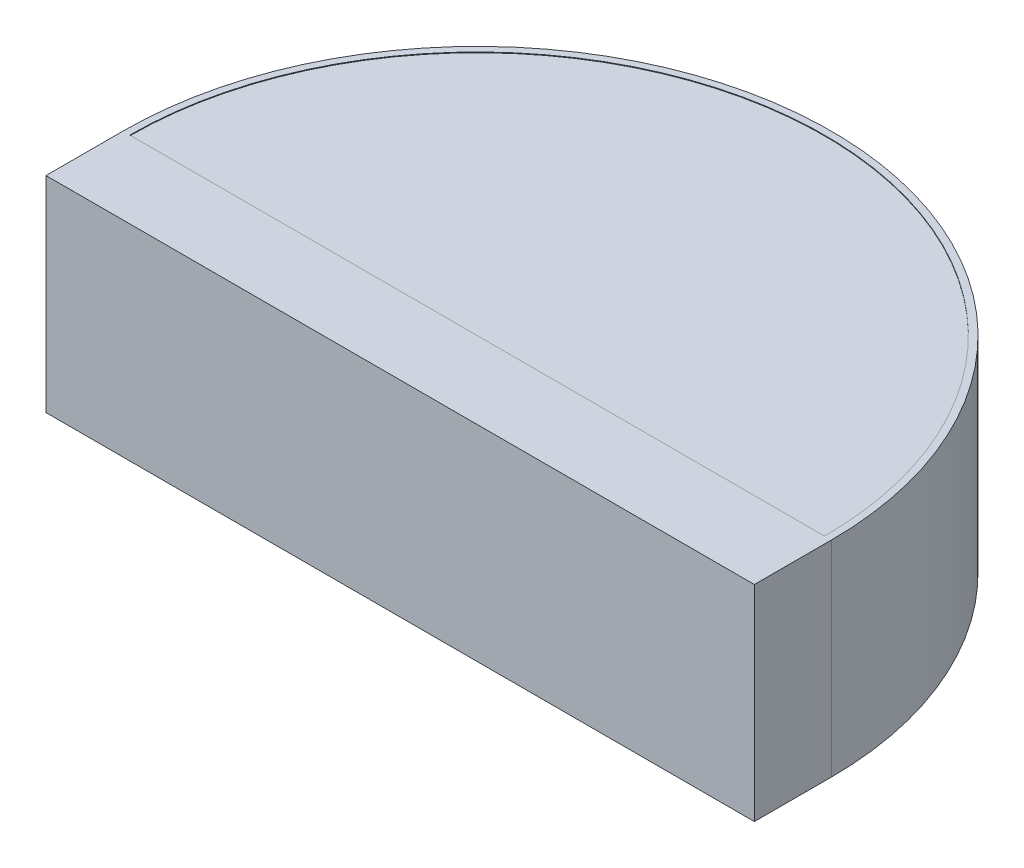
from build123d import *

# Parameters (mm, degrees)
SALIENTE_EXTRUIR1_DEPTH = 60
CORTAR_EXTRUIR1_DEPTH   = 0.2
CORTAR_EXTRUIR2_START   = -0.2
CORTAR_EXTRUIR2_DEPTH   = 0.2


with BuildPart() as part:
    # Croquis1 → Saliente-Extruir1 (new body)
    with BuildSketch(Plane(origin=(0, 0, 0), x_dir=(1, 0, 0), z_dir=(0, 1, 0))):
        with BuildLine():
            Line((103.5, 0), (-103.5, 0))
            Line((-103.5, 0), (-103.5, 22.5))
            ThreePointArc((-103.5, 22.5), (0, 126), (103.5, 22.5))
            Line((103.5, 22.5), (103.5, 0))
        make_face()
    extrude(amount=SALIENTE_EXTRUIR1_DEPTH)

    # Croquis2 → Cortar-Extruir1 (cut)
    with BuildSketch(Plane(origin=(0, 60, 0), x_dir=(1, 0, 0), z_dir=(0, 1, 0))):
        with BuildLine():
            Line((-101.5, 22.5), (101.5, 22.5))
            ThreePointArc((101.5, 22.5), (0, 124), (-101.5, 22.5))
        make_face()
    extrude(amount=-CORTAR_EXTRUIR1_DEPTH, mode=Mode.SUBTRACT)

    # Croquis3 → Cortar-Extruir2 (cut)
    with BuildSketch(Plane.XZ.offset(CORTAR_EXTRUIR2_START)):
        with BuildLine():
            Line((-101.5, -22.5), (101.5, -22.5))
            ThreePointArc((101.5, -22.5), (0, -124), (-101.5, -22.5))
        make_face()
    extrude(amount=CORTAR_EXTRUIR2_DEPTH, mode=Mode.SUBTRACT)


solid = part.part
